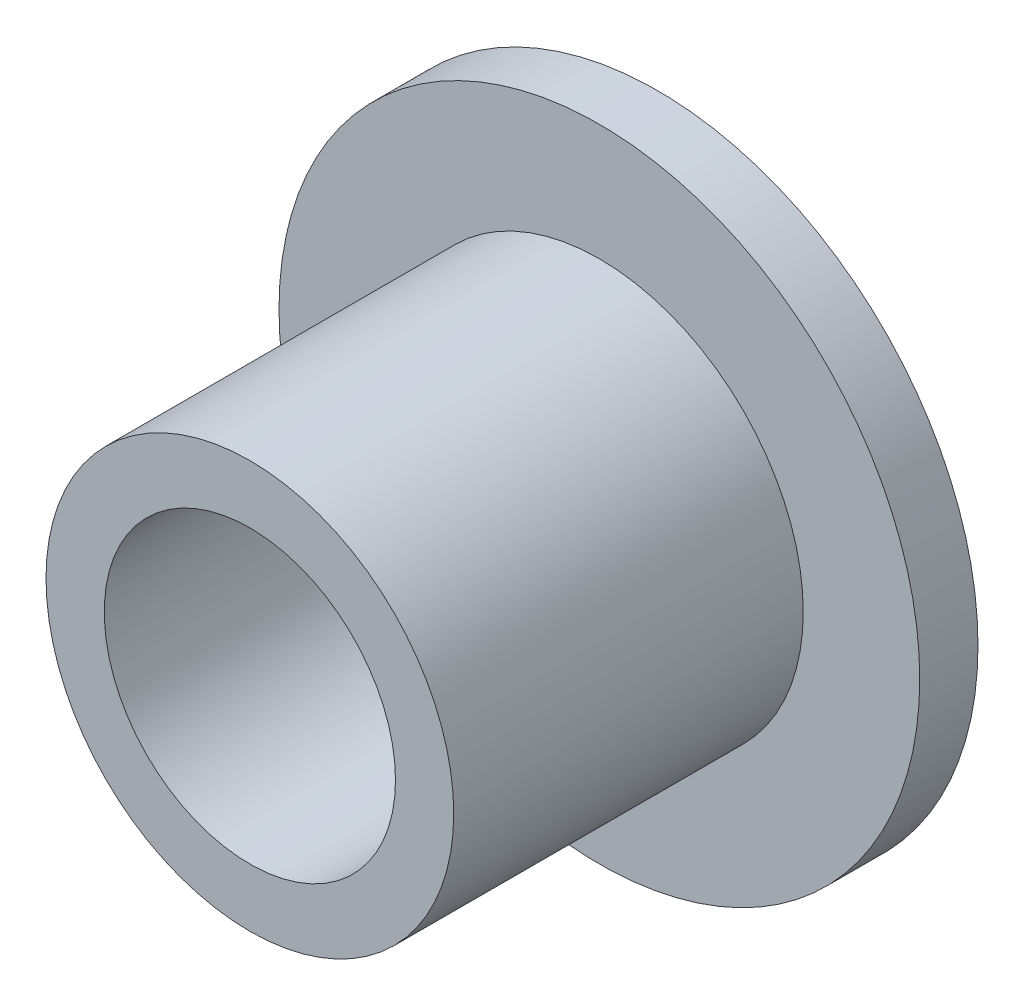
from build123d import *


with BuildPart() as part:
    # Skizze1 → Rotation1 (revolve)
    with BuildSketch(Plane(origin=(0, 0, 0), x_dir=(0, 0, -1), z_dir=(1, 0, 0)), mode=Mode.PRIVATE) as rotation1_sk:
        Polygon((0, 2.5), (7, 2.5), (7, 5.5), (6, 5.5), (6, 3.5), (0, 3.5), align=None)
    revolve(rotation1_sk.sketch.rotate(Axis((0, 0, 0), (0, 0, -1)), 90), axis=Axis((0, 0, 0), (0, 0, -1)))


solid = part.part
